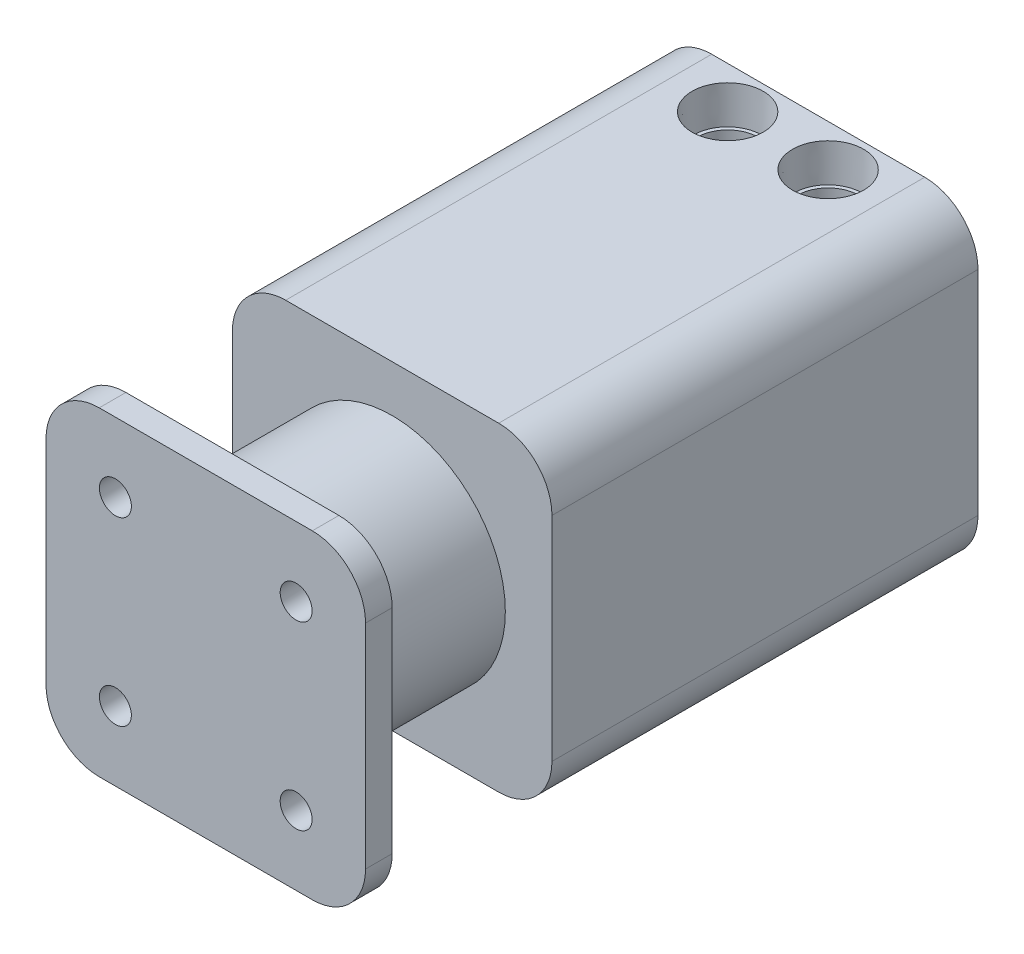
ISO-10303-21;
HEADER;
FILE_DESCRIPTION(('STEP AP214'),'2;1');
FILE_NAME('part.step','',(''),(''),'','','');
FILE_SCHEMA(('AUTOMOTIVE_DESIGN { 1 0 10303 214 1 1 1 1 }'));
ENDSEC;
DATA;
#1=APPLICATION_CONTEXT('core data for automotive mechanical design processes');
#2=APPLICATION_PROTOCOL_DEFINITION('international standard','automotive_design',2000,#1);
#3=PRODUCT_CONTEXT('',#1,'mechanical');
#4=PRODUCT('Part','Part','',(#3));
#5=PRODUCT_RELATED_PRODUCT_CATEGORY('part','',(#4));
#6=PRODUCT_DEFINITION_FORMATION('','',#4);
#7=PRODUCT_DEFINITION_CONTEXT('part definition',#1,'design');
#8=PRODUCT_DEFINITION('design','',#6,#7);
#9=PRODUCT_DEFINITION_SHAPE('','',#8);
#10=(LENGTH_UNIT() NAMED_UNIT(*) SI_UNIT(.MILLI.,.METRE.));
#11=(NAMED_UNIT(*) PLANE_ANGLE_UNIT() SI_UNIT($,.RADIAN.));
#12=(NAMED_UNIT(*) SI_UNIT($,.STERADIAN.) SOLID_ANGLE_UNIT());
#13=UNCERTAINTY_MEASURE_WITH_UNIT(LENGTH_MEASURE(1.E-05),#10,'distance_accuracy_value','');
#14=(GEOMETRIC_REPRESENTATION_CONTEXT(3) GLOBAL_UNCERTAINTY_ASSIGNED_CONTEXT((#13)) GLOBAL_UNIT_ASSIGNED_CONTEXT((#10,
#11,#12)) REPRESENTATION_CONTEXT('',''));
#15=CARTESIAN_POINT('',(0.,0.,0.));
#16=DIRECTION('',(0.,0.,1.));
#17=DIRECTION('',(1.,0.,0.));
#18=AXIS2_PLACEMENT_3D('',#15,#16,#17);
#19=CARTESIAN_POINT('',(-60.,60.,230.));
#20=DIRECTION('',(1.,0.,0.));
#21=DIRECTION('',(0.,1.,0.));
#22=AXIS2_PLACEMENT_3D('',#19,#20,#21);
#23=PLANE('',#22);
#24=DIRECTION('',(0.,-1.,0.));
#25=VECTOR('',#24,1.);
#26=CARTESIAN_POINT('',(-60.,60.,0.));
#27=LINE('',#26,#25);
#28=CARTESIAN_POINT('',(-60.,40.,0.));
#29=VERTEX_POINT('',#28);
#30=CARTESIAN_POINT('',(-60.,-40.,0.));
#31=VERTEX_POINT('',#30);
#32=EDGE_CURVE('E320',#29,#31,#27,.T.);
#33=ORIENTED_EDGE('',*,*,#32,.T.);
#34=DIRECTION('',(0.,0.,-1.));
#35=VECTOR('',#34,1.);
#36=CARTESIAN_POINT('',(-60.,-40.,230.));
#37=LINE('',#36,#35);
#38=CARTESIAN_POINT('',(-60.,-40.,160.));
#39=VERTEX_POINT('',#38);
#40=EDGE_CURVE('E396',#31,#39,#37,.F.);
#41=ORIENTED_EDGE('',*,*,#40,.T.);
#42=DIRECTION('',(0.,-1.,0.));
#43=VECTOR('',#42,1.);
#44=CARTESIAN_POINT('',(-60.,-132.141421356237,160.));
#45=LINE('',#44,#43);
#46=CARTESIAN_POINT('',(-60.,40.,160.));
#47=VERTEX_POINT('',#46);
#48=EDGE_CURVE('E314',#47,#39,#45,.T.);
#49=ORIENTED_EDGE('',*,*,#48,.F.);
#50=DIRECTION('',(0.,0.,-1.));
#51=VECTOR('',#50,1.);
#52=CARTESIAN_POINT('',(-60.,40.,230.));
#53=LINE('',#52,#51);
#54=EDGE_CURVE('E393',#47,#29,#53,.T.);
#55=ORIENTED_EDGE('',*,*,#54,.T.);
#56=EDGE_LOOP('',(#33,#41,#49,#55));
#57=FACE_BOUND('',#56,.T.);
#58=ADVANCED_FACE('F41',(#57),#23,.F.);
#59=CARTESIAN_POINT('',(-60.,-60.,230.));
#60=DIRECTION('',(0.,1.,0.));
#61=DIRECTION('',(0.,0.,1.));
#62=AXIS2_PLACEMENT_3D('',#59,#60,#61);
#63=PLANE('',#62);
#64=DIRECTION('',(1.,0.,0.));
#65=VECTOR('',#64,1.);
#66=CARTESIAN_POINT('',(0.,-60.,160.));
#67=LINE('',#66,#65);
#68=CARTESIAN_POINT('',(-40.,-60.,160.));
#69=VERTEX_POINT('',#68);
#70=CARTESIAN_POINT('',(40.,-60.,160.));
#71=VERTEX_POINT('',#70);
#72=EDGE_CURVE('E317',#69,#71,#67,.T.);
#73=ORIENTED_EDGE('',*,*,#72,.F.);
#74=DIRECTION('',(0.,0.,-1.));
#75=VECTOR('',#74,1.);
#76=CARTESIAN_POINT('',(-40.,-60.,230.));
#77=LINE('',#76,#75);
#78=CARTESIAN_POINT('',(-40.,-60.,0.));
#79=VERTEX_POINT('',#78);
#80=EDGE_CURVE('E382',#69,#79,#77,.T.);
#81=ORIENTED_EDGE('',*,*,#80,.T.);
#82=DIRECTION('',(1.,0.,0.));
#83=VECTOR('',#82,1.);
#84=CARTESIAN_POINT('',(-60.,-60.,0.));
#85=LINE('',#84,#83);
#86=CARTESIAN_POINT('',(40.,-60.,0.));
#87=VERTEX_POINT('',#86);
#88=EDGE_CURVE('E323',#79,#87,#85,.T.);
#89=ORIENTED_EDGE('',*,*,#88,.T.);
#90=DIRECTION('',(0.,0.,-1.));
#91=VECTOR('',#90,1.);
#92=CARTESIAN_POINT('',(40.,-60.,230.));
#93=LINE('',#92,#91);
#94=EDGE_CURVE('E380',#87,#71,#93,.F.);
#95=ORIENTED_EDGE('',*,*,#94,.T.);
#96=EDGE_LOOP('',(#73,#81,#89,#95));
#97=FACE_BOUND('',#96,.T.);
#98=ADVANCED_FACE('F458',(#97),#63,.F.);
#99=CARTESIAN_POINT('',(60.,60.,230.));
#100=DIRECTION('',(-1.,0.,0.));
#101=DIRECTION('',(0.,-1.,0.));
#102=AXIS2_PLACEMENT_3D('',#99,#100,#101);
#103=PLANE('',#102);
#104=DIRECTION('',(0.,1.,0.));
#105=VECTOR('',#104,1.);
#106=CARTESIAN_POINT('',(60.,-132.141421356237,160.));
#107=LINE('',#106,#105);
#108=CARTESIAN_POINT('',(60.,-40.,160.));
#109=VERTEX_POINT('',#108);
#110=CARTESIAN_POINT('',(60.,40.,160.));
#111=VERTEX_POINT('',#110);
#112=EDGE_CURVE('E308',#109,#111,#107,.T.);
#113=ORIENTED_EDGE('',*,*,#112,.F.);
#114=DIRECTION('',(0.,0.,-1.));
#115=VECTOR('',#114,1.);
#116=CARTESIAN_POINT('',(60.,-40.,230.));
#117=LINE('',#116,#115);
#118=CARTESIAN_POINT('',(60.,-40.,0.));
#119=VERTEX_POINT('',#118);
#120=EDGE_CURVE('E408',#109,#119,#117,.T.);
#121=ORIENTED_EDGE('',*,*,#120,.T.);
#122=DIRECTION('',(0.,1.,0.));
#123=VECTOR('',#122,1.);
#124=CARTESIAN_POINT('',(60.,60.,0.));
#125=LINE('',#124,#123);
#126=CARTESIAN_POINT('',(60.,40.,0.));
#127=VERTEX_POINT('',#126);
#128=EDGE_CURVE('E326',#119,#127,#125,.T.);
#129=ORIENTED_EDGE('',*,*,#128,.T.);
#130=DIRECTION('',(0.,0.,-1.));
#131=VECTOR('',#130,1.);
#132=CARTESIAN_POINT('',(60.,40.,230.));
#133=LINE('',#132,#131);
#134=EDGE_CURVE('E406',#127,#111,#133,.F.);
#135=ORIENTED_EDGE('',*,*,#134,.T.);
#136=EDGE_LOOP('',(#113,#121,#129,#135));
#137=FACE_BOUND('',#136,.T.);
#138=ADVANCED_FACE('F463',(#137),#103,.F.);
#139=CARTESIAN_POINT('',(-60.,60.,230.));
#140=DIRECTION('',(0.,-1.,0.));
#141=DIRECTION('',(0.,0.,-1.));
#142=AXIS2_PLACEMENT_3D('',#139,#140,#141);
#143=PLANE('',#142);
#144=CARTESIAN_POINT('',(-18.3052434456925,60.,15.7079219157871));
#145=DIRECTION('',(0.,1.,0.));
#146=DIRECTION('',(0.,0.,1.));
#147=AXIS2_PLACEMENT_3D('',#144,#145,#146);
#148=CIRCLE('',#147,13.3348857);
#149=CARTESIAN_POINT('',(-18.3052434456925,60.,29.0428076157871));
#150=VERTEX_POINT('',#149);
#151=EDGE_CURVE('E252',#150,#150,#148,.T.);
#152=ORIENTED_EDGE('',*,*,#151,.F.);
#153=EDGE_LOOP('',(#152));
#154=FACE_BOUND('',#153,.T.);
#155=CARTESIAN_POINT('',(19.4146521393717,60.,15.7079219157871));
#156=DIRECTION('',(0.,1.,0.));
#157=DIRECTION('',(0.,0.,1.));
#158=AXIS2_PLACEMENT_3D('',#155,#156,#157);
#159=CIRCLE('',#158,13.3348857);
#160=CARTESIAN_POINT('',(19.4146521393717,60.,29.0428076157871));
#161=VERTEX_POINT('',#160);
#162=EDGE_CURVE('E264',#161,#161,#159,.T.);
#163=ORIENTED_EDGE('',*,*,#162,.F.);
#164=EDGE_LOOP('',(#163));
#165=FACE_BOUND('',#164,.T.);
#166=DIRECTION('',(-1.,0.,0.));
#167=VECTOR('',#166,1.);
#168=CARTESIAN_POINT('',(-60.,60.,0.));
#169=LINE('',#168,#167);
#170=CARTESIAN_POINT('',(40.,60.,0.));
#171=VERTEX_POINT('',#170);
#172=CARTESIAN_POINT('',(-40.,60.,0.));
#173=VERTEX_POINT('',#172);
#174=EDGE_CURVE('E329',#171,#173,#169,.T.);
#175=ORIENTED_EDGE('',*,*,#174,.T.);
#176=DIRECTION('',(0.,0.,-1.));
#177=VECTOR('',#176,1.);
#178=CARTESIAN_POINT('',(-40.,60.,230.));
#179=LINE('',#178,#177);
#180=CARTESIAN_POINT('',(-40.,60.,160.));
#181=VERTEX_POINT('',#180);
#182=EDGE_CURVE('E414',#173,#181,#179,.F.);
#183=ORIENTED_EDGE('',*,*,#182,.T.);
#184=DIRECTION('',(-1.,0.,0.));
#185=VECTOR('',#184,1.);
#186=CARTESIAN_POINT('',(0.,60.,160.));
#187=LINE('',#186,#185);
#188=CARTESIAN_POINT('',(40.,60.,160.));
#189=VERTEX_POINT('',#188);
#190=EDGE_CURVE('E311',#189,#181,#187,.T.);
#191=ORIENTED_EDGE('',*,*,#190,.F.);
#192=DIRECTION('',(0.,0.,-1.));
#193=VECTOR('',#192,1.);
#194=CARTESIAN_POINT('',(40.,60.,230.));
#195=LINE('',#194,#193);
#196=EDGE_CURVE('E411',#189,#171,#195,.T.);
#197=ORIENTED_EDGE('',*,*,#196,.T.);
#198=EDGE_LOOP('',(#175,#183,#191,#197));
#199=FACE_BOUND('',#198,.T.);
#200=ADVANCED_FACE('F525',(#154,#165,#199),#143,.F.);
#201=CARTESIAN_POINT('',(-60.,-60.,0.));
#202=DIRECTION('',(0.,0.,1.));
#203=DIRECTION('',(1.,0.,0.));
#204=AXIS2_PLACEMENT_3D('',#201,#202,#203);
#205=PLANE('',#204);
#206=ORIENTED_EDGE('',*,*,#88,.F.);
#207=CARTESIAN_POINT('',(-40.,-40.,0.));
#208=DIRECTION('',(0.,0.,1.));
#209=DIRECTION('',(1.,0.,0.));
#210=AXIS2_PLACEMENT_3D('',#207,#208,#209);
#211=CIRCLE('',#210,20.);
#212=EDGE_CURVE('E391',#79,#31,#211,.F.);
#213=ORIENTED_EDGE('',*,*,#212,.T.);
#214=ORIENTED_EDGE('',*,*,#32,.F.);
#215=CARTESIAN_POINT('',(-40.,40.,0.));
#216=DIRECTION('',(0.,0.,1.));
#217=DIRECTION('',(1.,0.,0.));
#218=AXIS2_PLACEMENT_3D('',#215,#216,#217);
#219=CIRCLE('',#218,20.);
#220=EDGE_CURVE('E387',#29,#173,#219,.F.);
#221=ORIENTED_EDGE('',*,*,#220,.T.);
#222=ORIENTED_EDGE('',*,*,#174,.F.);
#223=CARTESIAN_POINT('',(40.,40.,0.));
#224=DIRECTION('',(0.,0.,1.));
#225=DIRECTION('',(1.,0.,0.));
#226=AXIS2_PLACEMENT_3D('',#223,#224,#225);
#227=CIRCLE('',#226,20.);
#228=EDGE_CURVE('E385',#171,#127,#227,.F.);
#229=ORIENTED_EDGE('',*,*,#228,.T.);
#230=ORIENTED_EDGE('',*,*,#128,.F.);
#231=CARTESIAN_POINT('',(40.,-40.,0.));
#232=DIRECTION('',(0.,0.,1.));
#233=DIRECTION('',(1.,0.,0.));
#234=AXIS2_PLACEMENT_3D('',#231,#232,#233);
#235=CIRCLE('',#234,20.);
#236=EDGE_CURVE('E389',#119,#87,#235,.F.);
#237=ORIENTED_EDGE('',*,*,#236,.T.);
#238=EDGE_LOOP('',(#206,#213,#214,#221,#222,#229,#230,#237));
#239=FACE_BOUND('',#238,.T.);
#240=ADVANCED_FACE('F523',(#239),#205,.F.);
#241=CARTESIAN_POINT('',(0.,0.,160.));
#242=DIRECTION('',(0.,0.,1.));
#243=DIRECTION('',(1.,0.,0.));
#244=AXIS2_PLACEMENT_3D('',#241,#242,#243);
#245=CYLINDRICAL_SURFACE('',#244,42.5);
#246=DIRECTION('',(0.,0.,1.));
#247=VECTOR('',#246,1.);
#248=CARTESIAN_POINT('',(28.4147625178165,31.6046083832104,220.));
#249=LINE('',#248,#247);
#250=CARTESIAN_POINT('',(28.4147625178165,31.6046083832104,210.));
#251=VERTEX_POINT('',#250);
#252=CARTESIAN_POINT('',(28.4147625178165,31.6046083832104,220.));
#253=VERTEX_POINT('',#252);
#254=EDGE_CURVE('E56',#251,#253,#249,.T.);
#255=ORIENTED_EDGE('',*,*,#254,.F.);
#256=CARTESIAN_POINT('',(0.,0.,210.));
#257=DIRECTION('',(0.,0.,1.));
#258=DIRECTION('',(1.,0.,0.));
#259=AXIS2_PLACEMENT_3D('',#256,#257,#258);
#260=CIRCLE('',#259,42.5);
#261=CARTESIAN_POINT('',(31.6046083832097,28.4147625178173,210.));
#262=VERTEX_POINT('',#261);
#263=EDGE_CURVE('E11',#251,#262,#260,.F.);
#264=ORIENTED_EDGE('',*,*,#263,.T.);
#265=DIRECTION('',(0.,0.,1.));
#266=VECTOR('',#265,1.);
#267=CARTESIAN_POINT('',(31.6046083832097,28.4147625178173,220.));
#268=LINE('',#267,#266);
#269=CARTESIAN_POINT('',(31.6046083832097,28.4147625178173,220.));
#270=VERTEX_POINT('',#269);
#271=EDGE_CURVE('E215',#270,#262,#268,.F.);
#272=ORIENTED_EDGE('',*,*,#271,.F.);
#273=CARTESIAN_POINT('',(0.,0.,220.));
#274=DIRECTION('',(0.,0.,1.));
#275=DIRECTION('',(1.,0.,0.));
#276=AXIS2_PLACEMENT_3D('',#273,#274,#275);
#277=CIRCLE('',#276,42.5);
#278=CARTESIAN_POINT('',(31.6046083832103,-28.4147625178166,220.));
#279=VERTEX_POINT('',#278);
#280=EDGE_CURVE('E434',#279,#270,#277,.T.);
#281=ORIENTED_EDGE('',*,*,#280,.F.);
#282=DIRECTION('',(0.,0.,1.));
#283=VECTOR('',#282,1.);
#284=CARTESIAN_POINT('',(31.6046083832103,-28.4147625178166,220.));
#285=LINE('',#284,#283);
#286=CARTESIAN_POINT('',(31.6046083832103,-28.4147625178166,210.));
#287=VERTEX_POINT('',#286);
#288=EDGE_CURVE('E64',#287,#279,#285,.T.);
#289=ORIENTED_EDGE('',*,*,#288,.F.);
#290=CARTESIAN_POINT('',(0.,0.,210.));
#291=DIRECTION('',(0.,0.,1.));
#292=DIRECTION('',(1.,0.,0.));
#293=AXIS2_PLACEMENT_3D('',#290,#291,#292);
#294=CIRCLE('',#293,42.5);
#295=CARTESIAN_POINT('',(28.4147625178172,-31.6046083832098,210.));
#296=VERTEX_POINT('',#295);
#297=EDGE_CURVE('E49',#287,#296,#294,.F.);
#298=ORIENTED_EDGE('',*,*,#297,.T.);
#299=DIRECTION('',(0.,0.,1.));
#300=VECTOR('',#299,1.);
#301=CARTESIAN_POINT('',(28.4147625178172,-31.6046083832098,220.));
#302=LINE('',#301,#300);
#303=CARTESIAN_POINT('',(28.4147625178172,-31.6046083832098,220.));
#304=VERTEX_POINT('',#303);
#305=EDGE_CURVE('E236',#304,#296,#302,.F.);
#306=ORIENTED_EDGE('',*,*,#305,.F.);
#307=CARTESIAN_POINT('',(-28.4147625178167,-31.6046083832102,220.));
#308=VERTEX_POINT('',#307);
#309=EDGE_CURVE('E293',#308,#304,#277,.T.);
#310=ORIENTED_EDGE('',*,*,#309,.F.);
#311=DIRECTION('',(0.,0.,1.));
#312=VECTOR('',#311,1.);
#313=CARTESIAN_POINT('',(-28.4147625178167,-31.6046083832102,220.));
#314=LINE('',#313,#312);
#315=CARTESIAN_POINT('',(-28.4147625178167,-31.6046083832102,210.));
#316=VERTEX_POINT('',#315);
#317=EDGE_CURVE('E250',#316,#308,#314,.T.);
#318=ORIENTED_EDGE('',*,*,#317,.F.);
#319=CARTESIAN_POINT('',(0.,0.,210.));
#320=DIRECTION('',(0.,0.,1.));
#321=DIRECTION('',(1.,0.,0.));
#322=AXIS2_PLACEMENT_3D('',#319,#320,#321);
#323=CIRCLE('',#322,42.5);
#324=CARTESIAN_POINT('',(-31.6046083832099,-28.4147625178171,210.));
#325=VERTEX_POINT('',#324);
#326=EDGE_CURVE('E419',#316,#325,#323,.F.);
#327=ORIENTED_EDGE('',*,*,#326,.T.);
#328=DIRECTION('',(0.,0.,1.));
#329=VECTOR('',#328,1.);
#330=CARTESIAN_POINT('',(-31.6046083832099,-28.4147625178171,220.));
#331=LINE('',#330,#329);
#332=CARTESIAN_POINT('',(-31.6046083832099,-28.4147625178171,220.));
#333=VERTEX_POINT('',#332);
#334=EDGE_CURVE('E248',#333,#325,#331,.F.);
#335=ORIENTED_EDGE('',*,*,#334,.F.);
#336=CARTESIAN_POINT('',(-31.6046083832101,28.4147625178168,220.));
#337=VERTEX_POINT('',#336);
#338=EDGE_CURVE('E289',#337,#333,#277,.T.);
#339=ORIENTED_EDGE('',*,*,#338,.F.);
#340=DIRECTION('',(0.,0.,1.));
#341=VECTOR('',#340,1.);
#342=CARTESIAN_POINT('',(-31.6046083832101,28.4147625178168,220.));
#343=LINE('',#342,#341);
#344=CARTESIAN_POINT('',(-31.6046083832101,28.4147625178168,210.));
#345=VERTEX_POINT('',#344);
#346=EDGE_CURVE('E287',#345,#337,#343,.T.);
#347=ORIENTED_EDGE('',*,*,#346,.F.);
#348=CARTESIAN_POINT('',(0.,0.,210.));
#349=DIRECTION('',(0.,0.,1.));
#350=DIRECTION('',(1.,0.,0.));
#351=AXIS2_PLACEMENT_3D('',#348,#349,#350);
#352=CIRCLE('',#351,42.5);
#353=CARTESIAN_POINT('',(-28.414762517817,31.60460838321,210.));
#354=VERTEX_POINT('',#353);
#355=EDGE_CURVE('E416',#345,#354,#352,.F.);
#356=ORIENTED_EDGE('',*,*,#355,.T.);
#357=DIRECTION('',(0.,0.,1.));
#358=VECTOR('',#357,1.);
#359=CARTESIAN_POINT('',(-28.414762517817,31.60460838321,220.));
#360=LINE('',#359,#358);
#361=CARTESIAN_POINT('',(-28.414762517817,31.60460838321,220.));
#362=VERTEX_POINT('',#361);
#363=EDGE_CURVE('E285',#362,#354,#360,.F.);
#364=ORIENTED_EDGE('',*,*,#363,.F.);
#365=EDGE_CURVE('E223',#253,#362,#277,.T.);
#366=ORIENTED_EDGE('',*,*,#365,.F.);
#367=EDGE_LOOP('',(#255,#264,#272,#281,#289,#298,#306,#310,#318,#327,#335,#339,#347,#356,#364,#366));
#368=FACE_BOUND('',#367,.T.);
#369=CARTESIAN_POINT('',(0.,0.,160.));
#370=DIRECTION('',(0.,0.,1.));
#371=DIRECTION('',(1.,0.,0.));
#372=AXIS2_PLACEMENT_3D('',#369,#370,#371);
#373=CIRCLE('',#372,42.5);
#374=CARTESIAN_POINT('',(42.5,0.,160.));
#375=VERTEX_POINT('',#374);
#376=EDGE_CURVE('E305',#375,#375,#373,.T.);
#377=ORIENTED_EDGE('',*,*,#376,.T.);
#378=EDGE_LOOP('',(#377));
#379=FACE_BOUND('',#378,.T.);
#380=ADVANCED_FACE('F220',(#368,#379),#245,.T.);
#381=CARTESIAN_POINT('',(0.,-132.141421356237,160.));
#382=DIRECTION('',(0.,0.,1.));
#383=DIRECTION('',(1.,0.,0.));
#384=AXIS2_PLACEMENT_3D('',#381,#382,#383);
#385=PLANE('',#384);
#386=ORIENTED_EDGE('',*,*,#376,.F.);
#387=EDGE_LOOP('',(#386));
#388=FACE_BOUND('',#387,.T.);
#389=ORIENTED_EDGE('',*,*,#48,.T.);
#390=CARTESIAN_POINT('',(-40.,-40.,160.));
#391=DIRECTION('',(0.,0.,1.));
#392=DIRECTION('',(1.,0.,0.));
#393=AXIS2_PLACEMENT_3D('',#390,#391,#392);
#394=CIRCLE('',#393,20.);
#395=EDGE_CURVE('E404',#39,#69,#394,.T.);
#396=ORIENTED_EDGE('',*,*,#395,.T.);
#397=ORIENTED_EDGE('',*,*,#72,.T.);
#398=CARTESIAN_POINT('',(40.,-40.,160.));
#399=DIRECTION('',(0.,0.,1.));
#400=DIRECTION('',(1.,0.,0.));
#401=AXIS2_PLACEMENT_3D('',#398,#399,#400);
#402=CIRCLE('',#401,20.);
#403=EDGE_CURVE('E402',#71,#109,#402,.T.);
#404=ORIENTED_EDGE('',*,*,#403,.T.);
#405=ORIENTED_EDGE('',*,*,#112,.T.);
#406=CARTESIAN_POINT('',(40.,40.,160.));
#407=DIRECTION('',(0.,0.,1.));
#408=DIRECTION('',(1.,0.,0.));
#409=AXIS2_PLACEMENT_3D('',#406,#407,#408);
#410=CIRCLE('',#409,20.);
#411=EDGE_CURVE('E398',#111,#189,#410,.T.);
#412=ORIENTED_EDGE('',*,*,#411,.T.);
#413=ORIENTED_EDGE('',*,*,#190,.T.);
#414=CARTESIAN_POINT('',(-40.,40.,160.));
#415=DIRECTION('',(0.,0.,1.));
#416=DIRECTION('',(1.,0.,0.));
#417=AXIS2_PLACEMENT_3D('',#414,#415,#416);
#418=CIRCLE('',#417,20.);
#419=EDGE_CURVE('E400',#181,#47,#418,.T.);
#420=ORIENTED_EDGE('',*,*,#419,.T.);
#421=EDGE_LOOP('',(#389,#396,#397,#404,#405,#412,#413,#420));
#422=FACE_BOUND('',#421,.T.);
#423=ADVANCED_FACE('F509',(#388,#422),#385,.T.);
#424=CARTESIAN_POINT('',(0.,-132.141421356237,220.));
#425=DIRECTION('',(0.,0.,1.));
#426=DIRECTION('',(1.,0.,0.));
#427=AXIS2_PLACEMENT_3D('',#424,#425,#426);
#428=PLANE('',#427);
#429=ORIENTED_EDGE('',*,*,#280,.T.);
#430=CARTESIAN_POINT('',(33.9411254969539,33.9411254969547,220.));
#431=DIRECTION('',(0.,0.,1.));
#432=DIRECTION('',(1.,0.,0.));
#433=AXIS2_PLACEMENT_3D('',#430,#431,#432);
#434=CIRCLE('',#433,6.);
#435=EDGE_CURVE('E216',#270,#253,#434,.T.);
#436=ORIENTED_EDGE('',*,*,#435,.T.);
#437=ORIENTED_EDGE('',*,*,#365,.T.);
#438=CARTESIAN_POINT('',(-33.9411254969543,33.9411254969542,220.));
#439=DIRECTION('',(0.,0.,1.));
#440=DIRECTION('',(1.,0.,0.));
#441=AXIS2_PLACEMENT_3D('',#438,#439,#440);
#442=CIRCLE('',#441,6.);
#443=EDGE_CURVE('E282',#362,#337,#442,.T.);
#444=ORIENTED_EDGE('',*,*,#443,.T.);
#445=ORIENTED_EDGE('',*,*,#338,.T.);
#446=CARTESIAN_POINT('',(-33.9411254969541,-33.9411254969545,220.));
#447=DIRECTION('',(0.,0.,1.));
#448=DIRECTION('',(1.,0.,0.));
#449=AXIS2_PLACEMENT_3D('',#446,#447,#448);
#450=CIRCLE('',#449,6.);
#451=EDGE_CURVE('E245',#333,#308,#450,.T.);
#452=ORIENTED_EDGE('',*,*,#451,.T.);
#453=ORIENTED_EDGE('',*,*,#309,.T.);
#454=CARTESIAN_POINT('',(33.9411254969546,-33.941125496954,220.));
#455=DIRECTION('',(0.,0.,1.));
#456=DIRECTION('',(1.,0.,0.));
#457=AXIS2_PLACEMENT_3D('',#454,#455,#456);
#458=CIRCLE('',#457,6.);
#459=EDGE_CURVE('E234',#304,#279,#458,.T.);
#460=ORIENTED_EDGE('',*,*,#459,.T.);
#461=EDGE_LOOP('',(#429,#436,#437,#444,#445,#452,#453,#460));
#462=FACE_BOUND('',#461,.T.);
#463=DIRECTION('',(1.,0.,0.));
#464=VECTOR('',#463,1.);
#465=CARTESIAN_POINT('',(0.,-60.,220.));
#466=LINE('',#465,#464);
#467=CARTESIAN_POINT('',(-40.,-60.,220.));
#468=VERTEX_POINT('',#467);
#469=CARTESIAN_POINT('',(40.,-60.,220.));
#470=VERTEX_POINT('',#469);
#471=EDGE_CURVE('E302',#468,#470,#466,.T.);
#472=ORIENTED_EDGE('',*,*,#471,.F.);
#473=CARTESIAN_POINT('',(-40.,-40.,220.));
#474=DIRECTION('',(0.,0.,1.));
#475=DIRECTION('',(1.,0.,0.));
#476=AXIS2_PLACEMENT_3D('',#473,#474,#475);
#477=CIRCLE('',#476,20.);
#478=CARTESIAN_POINT('',(-60.,-40.,220.));
#479=VERTEX_POINT('',#478);
#480=EDGE_CURVE('E355',#468,#479,#477,.F.);
#481=ORIENTED_EDGE('',*,*,#480,.T.);
#482=DIRECTION('',(0.,-1.,0.));
#483=VECTOR('',#482,1.);
#484=CARTESIAN_POINT('',(-60.,-132.141421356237,220.));
#485=LINE('',#484,#483);
#486=CARTESIAN_POINT('',(-60.,40.,220.));
#487=VERTEX_POINT('',#486);
#488=EDGE_CURVE('E299',#487,#479,#485,.T.);
#489=ORIENTED_EDGE('',*,*,#488,.F.);
#490=CARTESIAN_POINT('',(-40.,40.,220.));
#491=DIRECTION('',(0.,0.,1.));
#492=DIRECTION('',(1.,0.,0.));
#493=AXIS2_PLACEMENT_3D('',#490,#491,#492);
#494=CIRCLE('',#493,20.);
#495=CARTESIAN_POINT('',(-40.,60.,220.));
#496=VERTEX_POINT('',#495);
#497=EDGE_CURVE('E353',#487,#496,#494,.F.);
#498=ORIENTED_EDGE('',*,*,#497,.T.);
#499=DIRECTION('',(-1.,0.,0.));
#500=VECTOR('',#499,1.);
#501=CARTESIAN_POINT('',(0.,60.,220.));
#502=LINE('',#501,#500);
#503=CARTESIAN_POINT('',(40.,60.,220.));
#504=VERTEX_POINT('',#503);
#505=EDGE_CURVE('E296',#504,#496,#502,.T.);
#506=ORIENTED_EDGE('',*,*,#505,.F.);
#507=CARTESIAN_POINT('',(40.,40.,220.));
#508=DIRECTION('',(0.,0.,1.));
#509=DIRECTION('',(1.,0.,0.));
#510=AXIS2_PLACEMENT_3D('',#507,#508,#509);
#511=CIRCLE('',#510,20.);
#512=CARTESIAN_POINT('',(60.,40.,220.));
#513=VERTEX_POINT('',#512);
#514=EDGE_CURVE('E349',#504,#513,#511,.F.);
#515=ORIENTED_EDGE('',*,*,#514,.T.);
#516=DIRECTION('',(0.,1.,0.));
#517=VECTOR('',#516,1.);
#518=CARTESIAN_POINT('',(60.,-132.141421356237,220.));
#519=LINE('',#518,#517);
#520=CARTESIAN_POINT('',(60.,-40.,220.));
#521=VERTEX_POINT('',#520);
#522=EDGE_CURVE('E292',#521,#513,#519,.T.);
#523=ORIENTED_EDGE('',*,*,#522,.F.);
#524=CARTESIAN_POINT('',(40.,-40.,220.));
#525=DIRECTION('',(0.,0.,1.));
#526=DIRECTION('',(1.,0.,0.));
#527=AXIS2_PLACEMENT_3D('',#524,#525,#526);
#528=CIRCLE('',#527,20.);
#529=EDGE_CURVE('E351',#521,#470,#528,.F.);
#530=ORIENTED_EDGE('',*,*,#529,.T.);
#531=EDGE_LOOP('',(#472,#481,#489,#498,#506,#515,#523,#530));
#532=FACE_BOUND('',#531,.T.);
#533=ADVANCED_FACE('F432',(#462,#532),#428,.F.);
#534=CARTESIAN_POINT('',(-60.,-60.,230.));
#535=DIRECTION('',(0.,0.,1.));
#536=DIRECTION('',(1.,0.,0.));
#537=AXIS2_PLACEMENT_3D('',#534,#535,#536);
#538=PLANE('',#537);
#539=CARTESIAN_POINT('',(33.9411254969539,33.9411254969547,230.));
#540=DIRECTION('',(0.,0.,1.));
#541=DIRECTION('',(0.,-1.,0.));
#542=AXIS2_PLACEMENT_3D('',#539,#540,#541);
#543=CIRCLE('',#542,6.);
#544=CARTESIAN_POINT('',(33.9411254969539,27.9411254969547,230.));
#545=VERTEX_POINT('',#544);
#546=EDGE_CURVE('E217',#545,#545,#543,.T.);
#547=ORIENTED_EDGE('',*,*,#546,.F.);
#548=EDGE_LOOP('',(#547));
#549=FACE_BOUND('',#548,.T.);
#550=CARTESIAN_POINT('',(33.9411254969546,-33.941125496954,230.));
#551=DIRECTION('',(0.,0.,1.));
#552=DIRECTION('',(-1.,0.,0.));
#553=AXIS2_PLACEMENT_3D('',#550,#551,#552);
#554=CIRCLE('',#553,6.);
#555=CARTESIAN_POINT('',(27.9411254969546,-33.941125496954,230.));
#556=VERTEX_POINT('',#555);
#557=EDGE_CURVE('E224',#556,#556,#554,.T.);
#558=ORIENTED_EDGE('',*,*,#557,.F.);
#559=EDGE_LOOP('',(#558));
#560=FACE_BOUND('',#559,.T.);
#561=CARTESIAN_POINT('',(-33.9411254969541,-33.9411254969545,230.));
#562=DIRECTION('',(0.,0.,1.));
#563=DIRECTION('',(0.,1.,0.));
#564=AXIS2_PLACEMENT_3D('',#561,#562,#563);
#565=CIRCLE('',#564,6.);
#566=CARTESIAN_POINT('',(-33.9411254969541,-27.9411254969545,230.));
#567=VERTEX_POINT('',#566);
#568=EDGE_CURVE('E239',#567,#567,#565,.T.);
#569=ORIENTED_EDGE('',*,*,#568,.F.);
#570=EDGE_LOOP('',(#569));
#571=FACE_BOUND('',#570,.T.);
#572=CARTESIAN_POINT('',(-33.9411254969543,33.9411254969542,230.));
#573=DIRECTION('',(0.,0.,1.));
#574=DIRECTION('',(1.,0.,0.));
#575=AXIS2_PLACEMENT_3D('',#572,#573,#574);
#576=CIRCLE('',#575,6.);
#577=CARTESIAN_POINT('',(-27.9411254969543,33.9411254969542,230.));
#578=VERTEX_POINT('',#577);
#579=EDGE_CURVE('E276',#578,#578,#576,.T.);
#580=ORIENTED_EDGE('',*,*,#579,.F.);
#581=EDGE_LOOP('',(#580));
#582=FACE_BOUND('',#581,.T.);
#583=DIRECTION('',(0.,-1.,0.));
#584=VECTOR('',#583,1.);
#585=CARTESIAN_POINT('',(-60.,60.,230.));
#586=LINE('',#585,#584);
#587=CARTESIAN_POINT('',(-60.,40.,230.));
#588=VERTEX_POINT('',#587);
#589=CARTESIAN_POINT('',(-60.,-40.,230.));
#590=VERTEX_POINT('',#589);
#591=EDGE_CURVE('E332',#588,#590,#586,.T.);
#592=ORIENTED_EDGE('',*,*,#591,.T.);
#593=CARTESIAN_POINT('',(-40.,-40.,230.));
#594=DIRECTION('',(0.,0.,1.));
#595=DIRECTION('',(1.,0.,0.));
#596=AXIS2_PLACEMENT_3D('',#593,#594,#595);
#597=CIRCLE('',#596,20.);
#598=CARTESIAN_POINT('',(-40.,-60.,230.));
#599=VERTEX_POINT('',#598);
#600=EDGE_CURVE('E368',#590,#599,#597,.T.);
#601=ORIENTED_EDGE('',*,*,#600,.T.);
#602=DIRECTION('',(1.,0.,0.));
#603=VECTOR('',#602,1.);
#604=CARTESIAN_POINT('',(-60.,-60.,230.));
#605=LINE('',#604,#603);
#606=CARTESIAN_POINT('',(40.,-60.,230.));
#607=VERTEX_POINT('',#606);
#608=EDGE_CURVE('E335',#599,#607,#605,.T.);
#609=ORIENTED_EDGE('',*,*,#608,.T.);
#610=CARTESIAN_POINT('',(40.,-40.,230.));
#611=DIRECTION('',(0.,0.,1.));
#612=DIRECTION('',(1.,0.,0.));
#613=AXIS2_PLACEMENT_3D('',#610,#611,#612);
#614=CIRCLE('',#613,20.);
#615=CARTESIAN_POINT('',(60.,-40.,230.));
#616=VERTEX_POINT('',#615);
#617=EDGE_CURVE('E364',#607,#616,#614,.T.);
#618=ORIENTED_EDGE('',*,*,#617,.T.);
#619=DIRECTION('',(0.,1.,0.));
#620=VECTOR('',#619,1.);
#621=CARTESIAN_POINT('',(60.,60.,230.));
#622=LINE('',#621,#620);
#623=CARTESIAN_POINT('',(60.,40.,230.));
#624=VERTEX_POINT('',#623);
#625=EDGE_CURVE('E338',#616,#624,#622,.T.);
#626=ORIENTED_EDGE('',*,*,#625,.T.);
#627=CARTESIAN_POINT('',(40.,40.,230.));
#628=DIRECTION('',(0.,0.,1.));
#629=DIRECTION('',(1.,0.,0.));
#630=AXIS2_PLACEMENT_3D('',#627,#628,#629);
#631=CIRCLE('',#630,20.);
#632=CARTESIAN_POINT('',(40.,60.,230.));
#633=VERTEX_POINT('',#632);
#634=EDGE_CURVE('E362',#624,#633,#631,.T.);
#635=ORIENTED_EDGE('',*,*,#634,.T.);
#636=DIRECTION('',(-1.,0.,0.));
#637=VECTOR('',#636,1.);
#638=CARTESIAN_POINT('',(-60.,60.,230.));
#639=LINE('',#638,#637);
#640=CARTESIAN_POINT('',(-40.,60.,230.));
#641=VERTEX_POINT('',#640);
#642=EDGE_CURVE('E341',#633,#641,#639,.T.);
#643=ORIENTED_EDGE('',*,*,#642,.T.);
#644=CARTESIAN_POINT('',(-40.,40.,230.));
#645=DIRECTION('',(0.,0.,1.));
#646=DIRECTION('',(1.,0.,0.));
#647=AXIS2_PLACEMENT_3D('',#644,#645,#646);
#648=CIRCLE('',#647,20.);
#649=EDGE_CURVE('E366',#641,#588,#648,.T.);
#650=ORIENTED_EDGE('',*,*,#649,.T.);
#651=EDGE_LOOP('',(#592,#601,#609,#618,#626,#635,#643,#650));
#652=FACE_BOUND('',#651,.T.);
#653=ADVANCED_FACE('F486',(#549,#560,#571,#582,#652),#538,.T.);
#654=ORIENTED_EDGE('',*,*,#505,.T.);
#655=DIRECTION('',(0.,0.,-1.));
#656=VECTOR('',#655,1.);
#657=CARTESIAN_POINT('',(-40.,60.,230.));
#658=LINE('',#657,#656);
#659=EDGE_CURVE('E373',#496,#641,#658,.F.);
#660=ORIENTED_EDGE('',*,*,#659,.T.);
#661=ORIENTED_EDGE('',*,*,#642,.F.);
#662=DIRECTION('',(0.,0.,-1.));
#663=VECTOR('',#662,1.);
#664=CARTESIAN_POINT('',(40.,60.,230.));
#665=LINE('',#664,#663);
#666=EDGE_CURVE('E370',#633,#504,#665,.T.);
#667=ORIENTED_EDGE('',*,*,#666,.T.);
#668=EDGE_LOOP('',(#654,#660,#661,#667));
#669=FACE_BOUND('',#668,.T.);
#670=ADVANCED_FACE('F504',(#669),#143,.F.);
#671=ORIENTED_EDGE('',*,*,#625,.F.);
#672=DIRECTION('',(0.,0.,-1.));
#673=VECTOR('',#672,1.);
#674=CARTESIAN_POINT('',(60.,-40.,230.));
#675=LINE('',#674,#673);
#676=EDGE_CURVE('E377',#616,#521,#675,.T.);
#677=ORIENTED_EDGE('',*,*,#676,.T.);
#678=ORIENTED_EDGE('',*,*,#522,.T.);
#679=DIRECTION('',(0.,0.,-1.));
#680=VECTOR('',#679,1.);
#681=CARTESIAN_POINT('',(60.,40.,230.));
#682=LINE('',#681,#680);
#683=EDGE_CURVE('E375',#513,#624,#682,.F.);
#684=ORIENTED_EDGE('',*,*,#683,.T.);
#685=EDGE_LOOP('',(#671,#677,#678,#684));
#686=FACE_BOUND('',#685,.T.);
#687=ADVANCED_FACE('F476',(#686),#103,.F.);
#688=ORIENTED_EDGE('',*,*,#608,.F.);
#689=DIRECTION('',(0.,0.,-1.));
#690=VECTOR('',#689,1.);
#691=CARTESIAN_POINT('',(-40.,-60.,230.));
#692=LINE('',#691,#690);
#693=EDGE_CURVE('E346',#599,#468,#692,.T.);
#694=ORIENTED_EDGE('',*,*,#693,.T.);
#695=ORIENTED_EDGE('',*,*,#471,.T.);
#696=DIRECTION('',(0.,0.,-1.));
#697=VECTOR('',#696,1.);
#698=CARTESIAN_POINT('',(40.,-60.,230.));
#699=LINE('',#698,#697);
#700=EDGE_CURVE('E344',#470,#607,#699,.F.);
#701=ORIENTED_EDGE('',*,*,#700,.T.);
#702=EDGE_LOOP('',(#688,#694,#695,#701));
#703=FACE_BOUND('',#702,.T.);
#704=ADVANCED_FACE('F465',(#703),#63,.F.);
#705=ORIENTED_EDGE('',*,*,#488,.T.);
#706=DIRECTION('',(0.,0.,-1.));
#707=VECTOR('',#706,1.);
#708=CARTESIAN_POINT('',(-60.,-40.,230.));
#709=LINE('',#708,#707);
#710=EDGE_CURVE('E360',#479,#590,#709,.F.);
#711=ORIENTED_EDGE('',*,*,#710,.T.);
#712=ORIENTED_EDGE('',*,*,#591,.F.);
#713=DIRECTION('',(0.,0.,-1.));
#714=VECTOR('',#713,1.);
#715=CARTESIAN_POINT('',(-60.,40.,230.));
#716=LINE('',#715,#714);
#717=EDGE_CURVE('E357',#588,#487,#716,.T.);
#718=ORIENTED_EDGE('',*,*,#717,.T.);
#719=EDGE_LOOP('',(#705,#711,#712,#718));
#720=FACE_BOUND('',#719,.T.);
#721=ADVANCED_FACE('F43',(#720),#23,.F.);
#722=CARTESIAN_POINT('',(-40.,-40.,230.));
#723=DIRECTION('',(0.,0.,-1.));
#724=DIRECTION('',(-1.,0.,0.));
#725=AXIS2_PLACEMENT_3D('',#722,#723,#724);
#726=CYLINDRICAL_SURFACE('',#725,20.);
#727=ORIENTED_EDGE('',*,*,#600,.F.);
#728=ORIENTED_EDGE('',*,*,#710,.F.);
#729=ORIENTED_EDGE('',*,*,#480,.F.);
#730=ORIENTED_EDGE('',*,*,#693,.F.);
#731=EDGE_LOOP('',(#727,#728,#729,#730));
#732=FACE_BOUND('',#731,.T.);
#733=ADVANCED_FACE('F467',(#732),#726,.T.);
#734=CARTESIAN_POINT('',(-40.,40.,230.));
#735=DIRECTION('',(0.,0.,-1.));
#736=DIRECTION('',(-1.,0.,0.));
#737=AXIS2_PLACEMENT_3D('',#734,#735,#736);
#738=CYLINDRICAL_SURFACE('',#737,20.);
#739=ORIENTED_EDGE('',*,*,#649,.F.);
#740=ORIENTED_EDGE('',*,*,#659,.F.);
#741=ORIENTED_EDGE('',*,*,#497,.F.);
#742=ORIENTED_EDGE('',*,*,#717,.F.);
#743=EDGE_LOOP('',(#739,#740,#741,#742));
#744=FACE_BOUND('',#743,.T.);
#745=ADVANCED_FACE('F473',(#744),#738,.T.);
#746=CARTESIAN_POINT('',(40.,-40.,230.));
#747=DIRECTION('',(0.,0.,-1.));
#748=DIRECTION('',(-1.,0.,0.));
#749=AXIS2_PLACEMENT_3D('',#746,#747,#748);
#750=CYLINDRICAL_SURFACE('',#749,20.);
#751=ORIENTED_EDGE('',*,*,#617,.F.);
#752=ORIENTED_EDGE('',*,*,#700,.F.);
#753=ORIENTED_EDGE('',*,*,#529,.F.);
#754=ORIENTED_EDGE('',*,*,#676,.F.);
#755=EDGE_LOOP('',(#751,#752,#753,#754));
#756=FACE_BOUND('',#755,.T.);
#757=ADVANCED_FACE('F491',(#756),#750,.T.);
#758=CARTESIAN_POINT('',(40.,40.,230.));
#759=DIRECTION('',(0.,0.,-1.));
#760=DIRECTION('',(-1.,0.,0.));
#761=AXIS2_PLACEMENT_3D('',#758,#759,#760);
#762=CYLINDRICAL_SURFACE('',#761,20.);
#763=ORIENTED_EDGE('',*,*,#634,.F.);
#764=ORIENTED_EDGE('',*,*,#683,.F.);
#765=ORIENTED_EDGE('',*,*,#514,.F.);
#766=ORIENTED_EDGE('',*,*,#666,.F.);
#767=EDGE_LOOP('',(#763,#764,#765,#766));
#768=FACE_BOUND('',#767,.T.);
#769=ADVANCED_FACE('F499',(#768),#762,.T.);
#770=CARTESIAN_POINT('',(-40.,-40.,230.));
#771=DIRECTION('',(0.,0.,-1.));
#772=DIRECTION('',(-1.,0.,0.));
#773=AXIS2_PLACEMENT_3D('',#770,#771,#772);
#774=CYLINDRICAL_SURFACE('',#773,20.);
#775=ORIENTED_EDGE('',*,*,#395,.F.);
#776=ORIENTED_EDGE('',*,*,#40,.F.);
#777=ORIENTED_EDGE('',*,*,#212,.F.);
#778=ORIENTED_EDGE('',*,*,#80,.F.);
#779=EDGE_LOOP('',(#775,#776,#777,#778));
#780=FACE_BOUND('',#779,.T.);
#781=ADVANCED_FACE('F553',(#780),#774,.T.);
#782=CARTESIAN_POINT('',(40.,-40.,230.));
#783=DIRECTION('',(0.,0.,-1.));
#784=DIRECTION('',(-1.,0.,0.));
#785=AXIS2_PLACEMENT_3D('',#782,#783,#784);
#786=CYLINDRICAL_SURFACE('',#785,20.);
#787=ORIENTED_EDGE('',*,*,#403,.F.);
#788=ORIENTED_EDGE('',*,*,#94,.F.);
#789=ORIENTED_EDGE('',*,*,#236,.F.);
#790=ORIENTED_EDGE('',*,*,#120,.F.);
#791=EDGE_LOOP('',(#787,#788,#789,#790));
#792=FACE_BOUND('',#791,.T.);
#793=ADVANCED_FACE('F546',(#792),#786,.T.);
#794=CARTESIAN_POINT('',(-40.,40.,230.));
#795=DIRECTION('',(0.,0.,-1.));
#796=DIRECTION('',(-1.,0.,0.));
#797=AXIS2_PLACEMENT_3D('',#794,#795,#796);
#798=CYLINDRICAL_SURFACE('',#797,20.);
#799=ORIENTED_EDGE('',*,*,#419,.F.);
#800=ORIENTED_EDGE('',*,*,#182,.F.);
#801=ORIENTED_EDGE('',*,*,#220,.F.);
#802=ORIENTED_EDGE('',*,*,#54,.F.);
#803=EDGE_LOOP('',(#799,#800,#801,#802));
#804=FACE_BOUND('',#803,.T.);
#805=ADVANCED_FACE('F560',(#804),#798,.T.);
#806=CARTESIAN_POINT('',(40.,40.,230.));
#807=DIRECTION('',(0.,0.,-1.));
#808=DIRECTION('',(-1.,0.,0.));
#809=AXIS2_PLACEMENT_3D('',#806,#807,#808);
#810=CYLINDRICAL_SURFACE('',#809,20.);
#811=ORIENTED_EDGE('',*,*,#411,.F.);
#812=ORIENTED_EDGE('',*,*,#134,.F.);
#813=ORIENTED_EDGE('',*,*,#228,.F.);
#814=ORIENTED_EDGE('',*,*,#196,.F.);
#815=EDGE_LOOP('',(#811,#812,#813,#814));
#816=FACE_BOUND('',#815,.T.);
#817=ADVANCED_FACE('F455',(#816),#810,.T.);
#818=CARTESIAN_POINT('',(-33.9411254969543,33.9411254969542,210.));
#819=DIRECTION('',(0.,0.,1.));
#820=DIRECTION('',(1.,0.,0.));
#821=AXIS2_PLACEMENT_3D('',#818,#819,#820);
#822=CYLINDRICAL_SURFACE('',#821,6.);
#823=ORIENTED_EDGE('',*,*,#346,.T.);
#824=ORIENTED_EDGE('',*,*,#443,.F.);
#825=ORIENTED_EDGE('',*,*,#363,.T.);
#826=CARTESIAN_POINT('',(-33.9411254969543,33.9411254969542,210.));
#827=DIRECTION('',(0.,0.,1.));
#828=DIRECTION('',(1.,0.,0.));
#829=AXIS2_PLACEMENT_3D('',#826,#827,#828);
#830=CIRCLE('',#829,6.);
#831=EDGE_CURVE('E279',#345,#354,#830,.T.);
#832=ORIENTED_EDGE('',*,*,#831,.F.);
#833=EDGE_LOOP('',(#823,#824,#825,#832));
#834=FACE_BOUND('',#833,.T.);
#835=ORIENTED_EDGE('',*,*,#579,.T.);
#836=EDGE_LOOP('',(#835));
#837=FACE_BOUND('',#836,.T.);
#838=ADVANCED_FACE('F438',(#834,#837),#822,.F.);
#839=CARTESIAN_POINT('',(-33.9411254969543,33.9411254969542,210.));
#840=DIRECTION('',(0.,0.,1.));
#841=DIRECTION('',(1.,0.,0.));
#842=AXIS2_PLACEMENT_3D('',#839,#840,#841);
#843=PLANE('',#842);
#844=ORIENTED_EDGE('',*,*,#831,.T.);
#845=ORIENTED_EDGE('',*,*,#355,.F.);
#846=EDGE_LOOP('',(#844,#845));
#847=FACE_BOUND('',#846,.T.);
#848=ADVANCED_FACE('F443',(#847),#843,.T.);
#849=CARTESIAN_POINT('',(19.4146521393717,36.88,15.7079219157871));
#850=DIRECTION('',(0.,1.,0.));
#851=DIRECTION('',(0.,0.,1.));
#852=AXIS2_PLACEMENT_3D('',#849,#850,#851);
#853=CONICAL_SURFACE('',#852,11.5062,1.02974425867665);
#854=CARTESIAN_POINT('',(19.4146521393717,29.9663775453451,15.7079219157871));
#855=VERTEX_POINT('',#854);
#856=VERTEX_LOOP('',#855);
#857=FACE_BOUND('',#856,.T.);
#858=CARTESIAN_POINT('',(19.4146521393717,36.88,15.7079219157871));
#859=DIRECTION('',(0.,1.,0.));
#860=DIRECTION('',(0.,0.,1.));
#861=AXIS2_PLACEMENT_3D('',#858,#859,#860);
#862=CIRCLE('',#861,11.5062);
#863=CARTESIAN_POINT('',(19.4146521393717,36.88,27.2141219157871));
#864=VERTEX_POINT('',#863);
#865=EDGE_CURVE('E273',#864,#864,#862,.T.);
#866=ORIENTED_EDGE('',*,*,#865,.T.);
#867=EDGE_LOOP('',(#866));
#868=FACE_BOUND('',#867,.T.);
#869=ADVANCED_FACE('F445',(#857,#868),#853,.F.);
#870=CARTESIAN_POINT('',(19.4146521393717,60.,15.7079219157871));
#871=DIRECTION('',(0.,1.,0.));
#872=DIRECTION('',(0.,0.,1.));
#873=AXIS2_PLACEMENT_3D('',#870,#871,#872);
#874=CYLINDRICAL_SURFACE('',#873,11.5062);
#875=ORIENTED_EDGE('',*,*,#865,.F.);
#876=EDGE_LOOP('',(#875));
#877=FACE_BOUND('',#876,.T.);
#878=CARTESIAN_POINT('',(19.4146521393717,45.95,15.7079219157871));
#879=DIRECTION('',(0.,1.,0.));
#880=DIRECTION('',(0.,0.,1.));
#881=AXIS2_PLACEMENT_3D('',#878,#879,#880);
#882=CIRCLE('',#881,11.5062);
#883=CARTESIAN_POINT('',(19.4146521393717,45.95,27.2141219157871));
#884=VERTEX_POINT('',#883);
#885=EDGE_CURVE('E270',#884,#884,#882,.T.);
#886=ORIENTED_EDGE('',*,*,#885,.T.);
#887=EDGE_LOOP('',(#886));
#888=FACE_BOUND('',#887,.T.);
#889=ADVANCED_FACE('F452',(#877,#888),#874,.F.);
#890=CARTESIAN_POINT('',(30.9208521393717,45.95,15.7079219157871));
#891=DIRECTION('',(0.,-1.,0.));
#892=DIRECTION('',(0.,0.,-1.));
#893=AXIS2_PLACEMENT_3D('',#890,#891,#892);
#894=PLANE('',#893);
#895=ORIENTED_EDGE('',*,*,#885,.F.);
#896=EDGE_LOOP('',(#895));
#897=FACE_BOUND('',#896,.T.);
#898=CARTESIAN_POINT('',(19.4146521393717,45.95,15.7079219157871));
#899=DIRECTION('',(0.,1.,0.));
#900=DIRECTION('',(0.,0.,1.));
#901=AXIS2_PLACEMENT_3D('',#898,#899,#900);
#902=CIRCLE('',#901,12.914209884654);
#903=CARTESIAN_POINT('',(19.4146521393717,45.95,28.6221318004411));
#904=VERTEX_POINT('',#903);
#905=EDGE_CURVE('E267',#904,#904,#902,.T.);
#906=ORIENTED_EDGE('',*,*,#905,.T.);
#907=EDGE_LOOP('',(#906));
#908=FACE_BOUND('',#907,.T.);
#909=ADVANCED_FACE('F625',(#897,#908),#894,.F.);
#910=CARTESIAN_POINT('',(19.4146521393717,60.,15.7079219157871));
#911=DIRECTION('',(0.,1.,0.));
#912=DIRECTION('',(0.,0.,1.));
#913=AXIS2_PLACEMENT_3D('',#910,#911,#912);
#914=CONICAL_SURFACE('',#913,13.3348857,0.029932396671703);
#915=ORIENTED_EDGE('',*,*,#905,.F.);
#916=EDGE_LOOP('',(#915));
#917=FACE_BOUND('',#916,.T.);
#918=ORIENTED_EDGE('',*,*,#162,.T.);
#919=EDGE_LOOP('',(#918));
#920=FACE_BOUND('',#919,.T.);
#921=ADVANCED_FACE('F633',(#917,#920),#914,.F.);
#922=CARTESIAN_POINT('',(-18.3052434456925,36.88,15.7079219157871));
#923=DIRECTION('',(0.,1.,0.));
#924=DIRECTION('',(0.,0.,1.));
#925=AXIS2_PLACEMENT_3D('',#922,#923,#924);
#926=CONICAL_SURFACE('',#925,11.5062,1.02974425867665);
#927=CARTESIAN_POINT('',(-18.3052434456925,29.9663775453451,15.7079219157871));
#928=VERTEX_POINT('',#927);
#929=VERTEX_LOOP('',#928);
#930=FACE_BOUND('',#929,.T.);
#931=CARTESIAN_POINT('',(-18.3052434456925,36.88,15.7079219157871));
#932=DIRECTION('',(0.,1.,0.));
#933=DIRECTION('',(0.,0.,1.));
#934=AXIS2_PLACEMENT_3D('',#931,#932,#933);
#935=CIRCLE('',#934,11.5062);
#936=CARTESIAN_POINT('',(-18.3052434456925,36.88,27.2141219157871));
#937=VERTEX_POINT('',#936);
#938=EDGE_CURVE('E261',#937,#937,#935,.T.);
#939=ORIENTED_EDGE('',*,*,#938,.T.);
#940=EDGE_LOOP('',(#939));
#941=FACE_BOUND('',#940,.T.);
#942=ADVANCED_FACE('F641',(#930,#941),#926,.F.);
#943=CARTESIAN_POINT('',(-18.3052434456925,60.,15.7079219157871));
#944=DIRECTION('',(0.,1.,0.));
#945=DIRECTION('',(0.,0.,1.));
#946=AXIS2_PLACEMENT_3D('',#943,#944,#945);
#947=CYLINDRICAL_SURFACE('',#946,11.5062);
#948=ORIENTED_EDGE('',*,*,#938,.F.);
#949=EDGE_LOOP('',(#948));
#950=FACE_BOUND('',#949,.T.);
#951=CARTESIAN_POINT('',(-18.3052434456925,45.95,15.7079219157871));
#952=DIRECTION('',(0.,1.,0.));
#953=DIRECTION('',(0.,0.,1.));
#954=AXIS2_PLACEMENT_3D('',#951,#952,#953);
#955=CIRCLE('',#954,11.5062);
#956=CARTESIAN_POINT('',(-18.3052434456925,45.95,27.2141219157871));
#957=VERTEX_POINT('',#956);
#958=EDGE_CURVE('E258',#957,#957,#955,.T.);
#959=ORIENTED_EDGE('',*,*,#958,.T.);
#960=EDGE_LOOP('',(#959));
#961=FACE_BOUND('',#960,.T.);
#962=ADVANCED_FACE('F649',(#950,#961),#947,.F.);
#963=CARTESIAN_POINT('',(-6.79904344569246,45.95,15.7079219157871));
#964=DIRECTION('',(0.,-1.,0.));
#965=DIRECTION('',(0.,0.,-1.));
#966=AXIS2_PLACEMENT_3D('',#963,#964,#965);
#967=PLANE('',#966);
#968=ORIENTED_EDGE('',*,*,#958,.F.);
#969=EDGE_LOOP('',(#968));
#970=FACE_BOUND('',#969,.T.);
#971=CARTESIAN_POINT('',(-18.3052434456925,45.95,15.7079219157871));
#972=DIRECTION('',(0.,1.,0.));
#973=DIRECTION('',(0.,0.,1.));
#974=AXIS2_PLACEMENT_3D('',#971,#972,#973);
#975=CIRCLE('',#974,12.914209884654);
#976=CARTESIAN_POINT('',(-18.3052434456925,45.95,28.6221318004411));
#977=VERTEX_POINT('',#976);
#978=EDGE_CURVE('E255',#977,#977,#975,.T.);
#979=ORIENTED_EDGE('',*,*,#978,.T.);
#980=EDGE_LOOP('',(#979));
#981=FACE_BOUND('',#980,.T.);
#982=ADVANCED_FACE('F657',(#970,#981),#967,.F.);
#983=CARTESIAN_POINT('',(-18.3052434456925,60.,15.7079219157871));
#984=DIRECTION('',(0.,1.,0.));
#985=DIRECTION('',(0.,0.,1.));
#986=AXIS2_PLACEMENT_3D('',#983,#984,#985);
#987=CONICAL_SURFACE('',#986,13.3348857,0.0299323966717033);
#988=ORIENTED_EDGE('',*,*,#978,.F.);
#989=EDGE_LOOP('',(#988));
#990=FACE_BOUND('',#989,.T.);
#991=ORIENTED_EDGE('',*,*,#151,.T.);
#992=EDGE_LOOP('',(#991));
#993=FACE_BOUND('',#992,.T.);
#994=ADVANCED_FACE('F665',(#990,#993),#987,.F.);
#995=CARTESIAN_POINT('',(-33.9411254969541,-33.9411254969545,210.));
#996=DIRECTION('',(0.,0.,1.));
#997=DIRECTION('',(1.,0.,0.));
#998=AXIS2_PLACEMENT_3D('',#995,#996,#997);
#999=CYLINDRICAL_SURFACE('',#998,6.);
#1000=ORIENTED_EDGE('',*,*,#317,.T.);
#1001=ORIENTED_EDGE('',*,*,#451,.F.);
#1002=ORIENTED_EDGE('',*,*,#334,.T.);
#1003=CARTESIAN_POINT('',(-33.9411254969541,-33.9411254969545,210.));
#1004=DIRECTION('',(0.,0.,1.));
#1005=DIRECTION('',(0.,1.,0.));
#1006=AXIS2_PLACEMENT_3D('',#1003,#1004,#1005);
#1007=CIRCLE('',#1006,6.);
#1008=EDGE_CURVE('E242',#316,#325,#1007,.T.);
#1009=ORIENTED_EDGE('',*,*,#1008,.F.);
#1010=EDGE_LOOP('',(#1000,#1001,#1002,#1009));
#1011=FACE_BOUND('',#1010,.T.);
#1012=ORIENTED_EDGE('',*,*,#568,.T.);
#1013=EDGE_LOOP('',(#1012));
#1014=FACE_BOUND('',#1013,.T.);
#1015=ADVANCED_FACE('F673',(#1011,#1014),#999,.F.);
#1016=CARTESIAN_POINT('',(-33.9411254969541,-33.9411254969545,210.));
#1017=DIRECTION('',(0.,0.,1.));
#1018=DIRECTION('',(0.,1.,0.));
#1019=AXIS2_PLACEMENT_3D('',#1016,#1017,#1018);
#1020=PLANE('',#1019);
#1021=ORIENTED_EDGE('',*,*,#1008,.T.);
#1022=ORIENTED_EDGE('',*,*,#326,.F.);
#1023=EDGE_LOOP('',(#1021,#1022));
#1024=FACE_BOUND('',#1023,.T.);
#1025=ADVANCED_FACE('F681',(#1024),#1020,.T.);
#1026=CARTESIAN_POINT('',(33.9411254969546,-33.941125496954,210.));
#1027=DIRECTION('',(0.,0.,1.));
#1028=DIRECTION('',(1.,0.,0.));
#1029=AXIS2_PLACEMENT_3D('',#1026,#1027,#1028);
#1030=CYLINDRICAL_SURFACE('',#1029,6.);
#1031=ORIENTED_EDGE('',*,*,#288,.T.);
#1032=ORIENTED_EDGE('',*,*,#459,.F.);
#1033=ORIENTED_EDGE('',*,*,#305,.T.);
#1034=CARTESIAN_POINT('',(33.9411254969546,-33.941125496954,210.));
#1035=DIRECTION('',(0.,0.,1.));
#1036=DIRECTION('',(-1.,0.,0.));
#1037=AXIS2_PLACEMENT_3D('',#1034,#1035,#1036);
#1038=CIRCLE('',#1037,6.);
#1039=EDGE_CURVE('E227',#287,#296,#1038,.T.);
#1040=ORIENTED_EDGE('',*,*,#1039,.F.);
#1041=EDGE_LOOP('',(#1031,#1032,#1033,#1040));
#1042=FACE_BOUND('',#1041,.T.);
#1043=ORIENTED_EDGE('',*,*,#557,.T.);
#1044=EDGE_LOOP('',(#1043));
#1045=FACE_BOUND('',#1044,.T.);
#1046=ADVANCED_FACE('F428',(#1042,#1045),#1030,.F.);
#1047=CARTESIAN_POINT('',(33.9411254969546,-33.941125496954,210.));
#1048=DIRECTION('',(0.,0.,1.));
#1049=DIRECTION('',(-1.,0.,0.));
#1050=AXIS2_PLACEMENT_3D('',#1047,#1048,#1049);
#1051=PLANE('',#1050);
#1052=ORIENTED_EDGE('',*,*,#1039,.T.);
#1053=ORIENTED_EDGE('',*,*,#297,.F.);
#1054=EDGE_LOOP('',(#1052,#1053));
#1055=FACE_BOUND('',#1054,.T.);
#1056=ADVANCED_FACE('F427',(#1055),#1051,.T.);
#1057=CARTESIAN_POINT('',(33.9411254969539,33.9411254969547,210.));
#1058=DIRECTION('',(0.,0.,1.));
#1059=DIRECTION('',(1.,0.,0.));
#1060=AXIS2_PLACEMENT_3D('',#1057,#1058,#1059);
#1061=CYLINDRICAL_SURFACE('',#1060,6.);
#1062=ORIENTED_EDGE('',*,*,#254,.T.);
#1063=ORIENTED_EDGE('',*,*,#435,.F.);
#1064=ORIENTED_EDGE('',*,*,#271,.T.);
#1065=CARTESIAN_POINT('',(33.9411254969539,33.9411254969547,210.));
#1066=DIRECTION('',(0.,0.,1.));
#1067=DIRECTION('',(0.,-1.,0.));
#1068=AXIS2_PLACEMENT_3D('',#1065,#1066,#1067);
#1069=CIRCLE('',#1068,6.);
#1070=EDGE_CURVE('E210',#251,#262,#1069,.T.);
#1071=ORIENTED_EDGE('',*,*,#1070,.F.);
#1072=EDGE_LOOP('',(#1062,#1063,#1064,#1071));
#1073=FACE_BOUND('',#1072,.T.);
#1074=ORIENTED_EDGE('',*,*,#546,.T.);
#1075=EDGE_LOOP('',(#1074));
#1076=FACE_BOUND('',#1075,.T.);
#1077=ADVANCED_FACE('F213',(#1073,#1076),#1061,.F.);
#1078=CARTESIAN_POINT('',(33.9411254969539,33.9411254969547,210.));
#1079=DIRECTION('',(0.,0.,1.));
#1080=DIRECTION('',(0.,-1.,0.));
#1081=AXIS2_PLACEMENT_3D('',#1078,#1079,#1080);
#1082=PLANE('',#1081);
#1083=ORIENTED_EDGE('',*,*,#1070,.T.);
#1084=ORIENTED_EDGE('',*,*,#263,.F.);
#1085=EDGE_LOOP('',(#1083,#1084));
#1086=FACE_BOUND('',#1085,.T.);
#1087=ADVANCED_FACE('F209',(#1086),#1082,.T.);
#1088=CLOSED_SHELL('',(#58,#98,#138,#200,#240,#380,#423,#533,#653,#670,#687,#704,#721,#733,#745,
#757,#769,#781,#793,#805,#817,#838,#848,#869,#889,#909,#921,#942,#962,#982,#994,#1015,#1025,
#1046,#1056,#1077,#1087));
#1089=MANIFOLD_SOLID_BREP('B2',#1088);
#1090=ADVANCED_BREP_SHAPE_REPRESENTATION('',(#18,#1089),#14);
#1091=SHAPE_DEFINITION_REPRESENTATION(#9,#1090);
ENDSEC;
END-ISO-10303-21;
